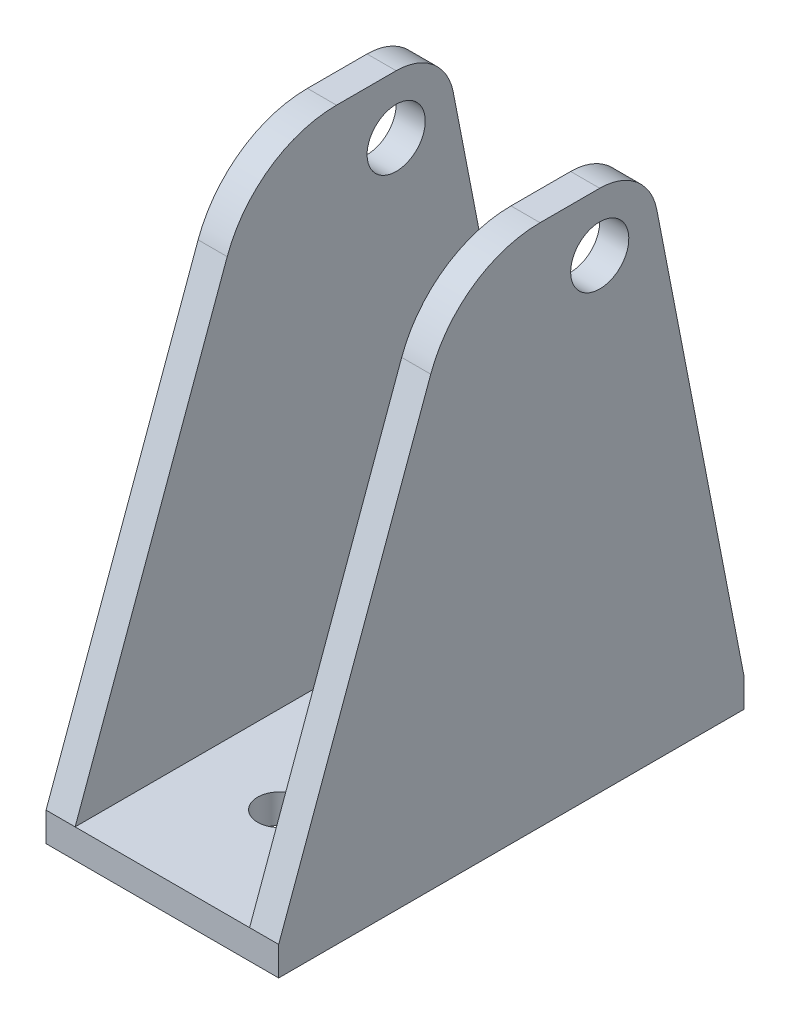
from build123d import *

# Parameters (mm, degrees)
BOSS_EXTRUDE1_DEPTH = 38.1
CUT_EXTRUDE1_REACH  = 74.192
SKETCH2_R           = 3.175
CUT_EXTRUDE2_REACH  = 72.782
SKETCH3_R           = 2.38125
BOSS_EXTRUDE2_DEPTH = 9.398
BOSS_EXTRUDE3_DEPTH = 3.302
CUT_EXTRUDE3_REACH  = 75.988
CUT_EXTRUDE4_REACH  = 75.988
SKETCH8_W           = 3.175
SKETCH8_H           = 50.8
BOSS_EXTRUDE4_DEPTH = 53.975
CUT_EXTRUDE5_REACH  = 75.988
CUT_EXTRUDE6_REACH  = 75.988
SKETCH10_R          = 3.175
BOSS_EXTRUDE5_DEPTH = 3.175
BOSS_EXTRUDE7_DEPTH = 3.175
FILLET3_R           = 12.7


with BuildPart() as part:
    # Sketch1 → Boss-Extrude1 (new body)
    with BuildSketch(Plane.XY):
        Polygon((3.175, 0), (0, 0), (0, -57.15), (25.4, -57.15), (25.4, -53.975), (3.175, -53.975), align=None)
    extrude(amount=BOSS_EXTRUDE1_DEPTH)

    # Sketch2 → Cut-Extrude1 (cut, up to next)
    with BuildSketch(Plane(origin=(3.175, 0, 0), x_dir=(0, 0, -1), z_dir=(1, 0, 0)), mode=Mode.PRIVATE) as cut_extrude1_sk1:
        with Locations(Location((-6.35, -6.35, 0), (0, 0, 90))):
            Circle(SKETCH2_R)
    cut_extrude1_tool1 = extrude(cut_extrude1_sk1.sketch, amount=-CUT_EXTRUDE1_REACH, mode=Mode.PRIVATE) & part.part
    add(cut_extrude1_tool1.solids().sort_by_distance((3.175, -6.35, 6.35))[0], mode=Mode.SUBTRACT)

    # Sketch3 → Cut-Extrude2 (cut, up to next)
    with BuildSketch(Plane(origin=(0, -53.975, 0), x_dir=(1, 0, 0), z_dir=(0, 1, 0)), mode=Mode.PRIVATE) as cut_extrude2_sk1:
        with Locations(Location((12.7, -3.224657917, 0), (0, 0, 270))):
            Circle(SKETCH3_R)
    cut_extrude2_tool1 = extrude(cut_extrude2_sk1.sketch, amount=-CUT_EXTRUDE2_REACH, mode=Mode.PRIVATE) & part.part
    # Sketch3 → Cut-Extrude2 (cut, up to next)
    with BuildSketch(Plane(origin=(0, -53.975, 0), x_dir=(1, 0, 0), z_dir=(0, 1, 0)), mode=Mode.PRIVATE) as cut_extrude2_sk2:
        with Locations(Location((12.7, -28.624657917, 0), (0, 0, 270))):
            Circle(SKETCH3_R)
    cut_extrude2_tool2 = extrude(cut_extrude2_sk2.sketch, amount=-CUT_EXTRUDE2_REACH, mode=Mode.PRIVATE) & part.part
    add(cut_extrude2_tool1.solids().sort_by_distance((12.7, -53.975, 3.224658))[0], mode=Mode.SUBTRACT)
    add(cut_extrude2_tool2.solids().sort_by_distance((12.7, -53.975, 28.624658))[0], mode=Mode.SUBTRACT)

    # Sketch4 → Boss-Extrude2 (add)
    with BuildSketch(Plane(origin=(0, 0, 0), x_dir=(-1, 0, 0), z_dir=(0, 0, -1))):
        Polygon((0, -57.15), (0, 0), (-3.175, 0), (-3.175, -53.975), (-25.4, -53.975), (-25.4, -57.15), align=None)
    extrude(amount=BOSS_EXTRUDE2_DEPTH)

    # Sketch5 → Boss-Extrude3 (add)
    with BuildSketch(Plane.XY.offset(38.1)):
        Polygon((0, 0), (0, -57.15), (25.4, -57.15), (25.4, -53.975), (3.175, -53.975), (3.175, 0), align=None)
    extrude(amount=BOSS_EXTRUDE3_DEPTH)

    # Sketch6 → Cut-Extrude3 (cut, up to next)
    with BuildSketch(Plane(origin=(3.175, 0, 0), x_dir=(0, 0, -1), z_dir=(1, 0, 0)), mode=Mode.PRIVATE) as cut_extrude3_sk1:
        with BuildLine():
            Line((-41.402, 0), (-6.35, 0))
            ThreePointArc((-6.35, 0), (-9.515947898, -0.845522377), (-11.838784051, -3.156921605))
            Line((-11.838784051, -3.156921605), (-41.402, -53.975))
            Line((-41.402, -53.975), (-41.402, 0))
        make_face()
    cut_extrude3_tool1 = extrude(cut_extrude3_sk1.sketch, amount=-CUT_EXTRUDE3_REACH, mode=Mode.PRIVATE) & part.part
    add(cut_extrude3_tool1.solids().sort_by_distance((3.175, -17.947904, 30.881595))[0], mode=Mode.SUBTRACT)

    # Sketch7 → Cut-Extrude4 (cut, up to next)
    with BuildSketch(Plane(origin=(3.175, 0, 0), x_dir=(0, 0, -1), z_dir=(1, 0, 0)), mode=Mode.PRIVATE) as cut_extrude4_sk1:
        with BuildLine():
            Line((-0.117188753, -5.135683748), (9.398, -53.975))
            Line((9.398, -53.975), (9.398, 0))
            Line((9.398, 0), (-6.35, 0))
            ThreePointArc((-6.35, 0), (-2.311956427, -1.449315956), (-0.117188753, -5.135683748))
        make_face()
    cut_extrude4_tool1 = extrude(cut_extrude4_sk1.sketch, amount=-CUT_EXTRUDE4_REACH, mode=Mode.PRIVATE) & part.part
    add(cut_extrude4_tool1.solids().sort_by_distance((3.175, -17.674583, -5.743713))[0], mode=Mode.SUBTRACT)

    # Sketch8 → Boss-Extrude4 (add)
    with BuildSketch(Plane(origin=(0, -53.975, 0), x_dir=(1, 0, 0), z_dir=(0, 1, 0))):
        with Locations((23.8125, -16.002)):
            Rectangle(SKETCH8_W, SKETCH8_H)
    extrude(amount=BOSS_EXTRUDE4_DEPTH)

    # Sketch9 → Cut-Extrude5 (cut, up to next)
    with BuildSketch(Plane.ZY.offset(-22.225), mode=Mode.PRIVATE) as cut_extrude5_sk1:
        with BuildLine():
            Line((41.402, 0), (41.402, -53.975))
            Line((41.402, -53.975), (11.838784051, -3.156921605))
            ThreePointArc((11.838784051, -3.156921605), (9.515947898, -0.845522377), (6.35, 0))
            Line((6.35, 0), (41.402, 0))
        make_face()
    cut_extrude5_tool1 = extrude(cut_extrude5_sk1.sketch, amount=-CUT_EXTRUDE5_REACH, mode=Mode.PRIVATE) & part.part
    add(cut_extrude5_tool1.solids().sort_by_distance((22.225, -17.947904, 30.881595))[0], mode=Mode.SUBTRACT)

    # Sketch10 → Cut-Extrude6 (cut, up to next)
    with BuildSketch(Plane.ZY.offset(-22.225), mode=Mode.PRIVATE) as cut_extrude6_sk1:
        with Locations(Location((6.35, -6.35, 0), (0, 0, 90))):
            Circle(SKETCH10_R)
    cut_extrude6_tool1 = extrude(cut_extrude6_sk1.sketch, amount=-CUT_EXTRUDE6_REACH, mode=Mode.PRIVATE) & part.part
    # Sketch10 → Cut-Extrude6 (cut, up to next)
    with BuildSketch(Plane.ZY.offset(-22.225), mode=Mode.PRIVATE) as cut_extrude6_sk2:
        with BuildLine():
            Line((6.35, 0), (-9.398, 0))
            Line((-9.398, 0), (-9.398, -53.975))
            Line((-9.398, -53.975), (0.117188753, -5.135683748))
            ThreePointArc((0.117188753, -5.135683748), (2.311956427, -1.449315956), (6.35, 0))
        make_face()
    cut_extrude6_tool2 = extrude(cut_extrude6_sk2.sketch, amount=-CUT_EXTRUDE6_REACH, mode=Mode.PRIVATE) & part.part
    add(cut_extrude6_tool1.solids().sort_by_distance((22.225, -6.35, 6.35))[0], mode=Mode.SUBTRACT)
    add(cut_extrude6_tool2.solids().sort_by_distance((22.225, -17.674583, -5.743713))[0], mode=Mode.SUBTRACT)

    # Sketch11 → Boss-Extrude5 (add)
    with BuildSketch(Plane(origin=(25.4, 0, 0), x_dir=(0, 0, -1), z_dir=(1, 0, 0))):
        with BuildLine():
            Line((-6.35, 0), (-21.756706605, 0))
            Line((-21.756706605, 0), (-41.402, -53.975))
            Line((-41.402, -53.975), (-11.838784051, -3.156921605))
            ThreePointArc((-11.838784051, -3.156921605), (-9.515947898, -0.845522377), (-6.35, 0))
        make_face()
    extrude(amount=-BOSS_EXTRUDE5_DEPTH)

    # Sketch12 → Boss-Extrude7 (add)
    with BuildSketch(Plane.ZY):
        with BuildLine():
            Line((41.402, -53.975), (21.756706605, 0))
            Line((21.756706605, 0), (6.35, 0))
            ThreePointArc((6.35, 0), (9.515947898, -0.845522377), (11.838784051, -3.156921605))
            Line((11.838784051, -3.156921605), (41.402, -53.975))
        make_face()
    extrude(amount=-BOSS_EXTRUDE7_DEPTH)

    # Fillet3
    fillet3_edges = [part.edges().sort_by_distance(p)[0] for p in [
        (23.8125, 0, 21.756706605),
        (1.5875, 0, 21.756706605),
    ]]
    fillet(fillet3_edges, radius=FILLET3_R)


solid = part.part
